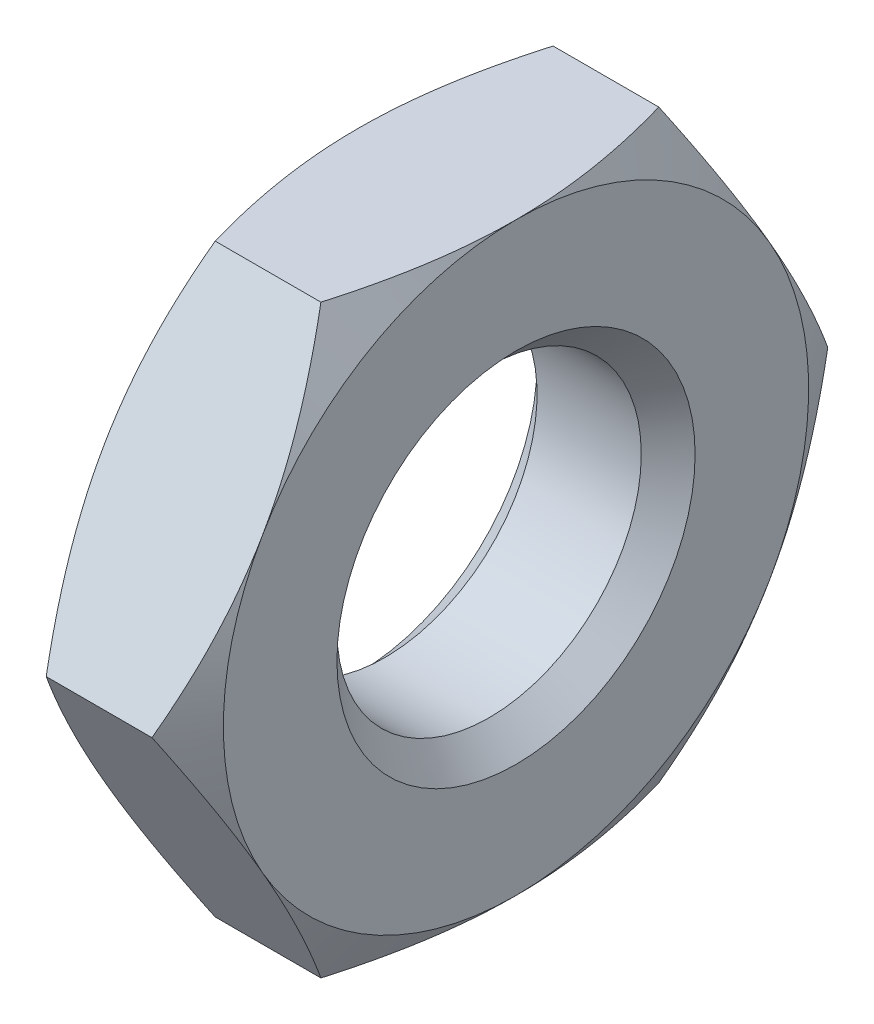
from build123d import *

# Parameters (mm, degrees)
SKETCH1_R      = 1.3
EXTRUDE1_DEPTH = 1.35
CHAMFER1_SIZE  = 0.23


with BuildPart() as part:
    # Sketch1 → Extrude1 (new body)
    with BuildSketch(Plane(origin=(0, 0, 0), x_dir=(0, 0, -1), z_dir=(1, 0, 0))):
        Polygon((1.443375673, 2.5), (-1.443375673, 2.5), (-2.886751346, 0), (-1.443375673, -2.5), (1.443375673, -2.5), (2.886751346, 0), align=None)
        with Locations(Location((0, 0, 0), (0, 0, 180))):
            Circle(SKETCH1_R, mode=Mode.SUBTRACT)
    extrude(amount=EXTRUDE1_DEPTH)

    # Sketch2 → Cut-Revolve1 (revolve, cut)
    with BuildSketch(Plane.XY):
        Polygon((1.35, 2.5), (1.35, 10), (0, 10), (0, 2.5), (0.675, 3.669134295), align=None)
    revolve(axis=Axis((1.35, 0, 0), (-1, 0, 0)), mode=Mode.SUBTRACT)

    # Chamfer1
    chamfer1_edges = [part.edges().sort_by_distance(p)[0] for p in [
        (0, 0, -1.3),
        (1.35, 0, -1.3),
    ]]
    chamfer(chamfer1_edges, length=CHAMFER1_SIZE)


solid = part.part
